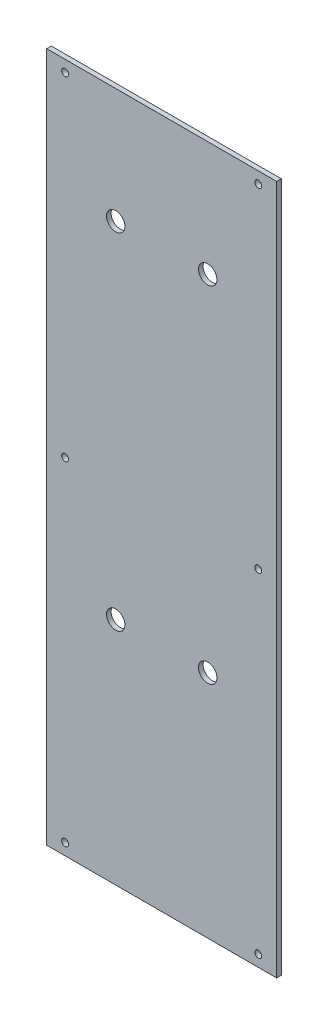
ISO-10303-21;
HEADER;
FILE_DESCRIPTION(('STEP AP214'),'2;1');
FILE_NAME('part.step','',(''),(''),'','','');
FILE_SCHEMA(('AUTOMOTIVE_DESIGN { 1 0 10303 214 1 1 1 1 }'));
ENDSEC;
DATA;
#1=APPLICATION_CONTEXT('core data for automotive mechanical design processes');
#2=APPLICATION_PROTOCOL_DEFINITION('international standard','automotive_design',2000,#1);
#3=PRODUCT_CONTEXT('',#1,'mechanical');
#4=PRODUCT('Part','Part','',(#3));
#5=PRODUCT_RELATED_PRODUCT_CATEGORY('part','',(#4));
#6=PRODUCT_DEFINITION_FORMATION('','',#4);
#7=PRODUCT_DEFINITION_CONTEXT('part definition',#1,'design');
#8=PRODUCT_DEFINITION('design','',#6,#7);
#9=PRODUCT_DEFINITION_SHAPE('','',#8);
#10=(LENGTH_UNIT() NAMED_UNIT(*) SI_UNIT(.MILLI.,.METRE.));
#11=(NAMED_UNIT(*) PLANE_ANGLE_UNIT() SI_UNIT($,.RADIAN.));
#12=(NAMED_UNIT(*) SI_UNIT($,.STERADIAN.) SOLID_ANGLE_UNIT());
#13=UNCERTAINTY_MEASURE_WITH_UNIT(LENGTH_MEASURE(1.E-05),#10,'distance_accuracy_value','');
#14=(GEOMETRIC_REPRESENTATION_CONTEXT(3) GLOBAL_UNCERTAINTY_ASSIGNED_CONTEXT((#13)) GLOBAL_UNIT_ASSIGNED_CONTEXT((#10,
#11,#12)) REPRESENTATION_CONTEXT('',''));
#15=CARTESIAN_POINT('',(0.,0.,0.));
#16=DIRECTION('',(0.,0.,1.));
#17=DIRECTION('',(1.,0.,0.));
#18=AXIS2_PLACEMENT_3D('',#15,#16,#17);
#19=CARTESIAN_POINT('',(0.,0.,2.));
#20=DIRECTION('',(1.,0.,0.));
#21=DIRECTION('',(0.,0.,-1.));
#22=AXIS2_PLACEMENT_3D('',#19,#20,#21);
#23=PLANE('',#22);
#24=DIRECTION('',(0.,-1.,0.));
#25=VECTOR('',#24,1.);
#26=CARTESIAN_POINT('',(0.,0.,0.));
#27=LINE('',#26,#25);
#28=CARTESIAN_POINT('',(0.,300.,0.));
#29=VERTEX_POINT('',#28);
#30=CARTESIAN_POINT('',(0.,0.,0.));
#31=VERTEX_POINT('',#30);
#32=EDGE_CURVE('E73',#29,#31,#27,.T.);
#33=ORIENTED_EDGE('',*,*,#32,.T.);
#34=DIRECTION('',(0.,0.,-1.));
#35=VECTOR('',#34,1.);
#36=CARTESIAN_POINT('',(0.,0.,2.));
#37=LINE('',#36,#35);
#38=CARTESIAN_POINT('',(0.,0.,2.));
#39=VERTEX_POINT('',#38);
#40=EDGE_CURVE('E80',#39,#31,#37,.T.);
#41=ORIENTED_EDGE('',*,*,#40,.F.);
#42=DIRECTION('',(0.,-1.,0.));
#43=VECTOR('',#42,1.);
#44=CARTESIAN_POINT('',(0.,0.,2.));
#45=LINE('',#44,#43);
#46=CARTESIAN_POINT('',(0.,300.,2.));
#47=VERTEX_POINT('',#46);
#48=EDGE_CURVE('E100',#47,#39,#45,.T.);
#49=ORIENTED_EDGE('',*,*,#48,.F.);
#50=DIRECTION('',(0.,0.,-1.));
#51=VECTOR('',#50,1.);
#52=CARTESIAN_POINT('',(0.,300.,2.));
#53=LINE('',#52,#51);
#54=EDGE_CURVE('E89',#47,#29,#53,.T.);
#55=ORIENTED_EDGE('',*,*,#54,.T.);
#56=EDGE_LOOP('',(#33,#41,#49,#55));
#57=FACE_BOUND('',#56,.T.);
#58=ADVANCED_FACE('F26',(#57),#23,.F.);
#59=CARTESIAN_POINT('',(0.,0.,2.));
#60=DIRECTION('',(0.,1.,0.));
#61=DIRECTION('',(0.,0.,1.));
#62=AXIS2_PLACEMENT_3D('',#59,#60,#61);
#63=PLANE('',#62);
#64=DIRECTION('',(1.,0.,0.));
#65=VECTOR('',#64,1.);
#66=CARTESIAN_POINT('',(0.,0.,0.));
#67=LINE('',#66,#65);
#68=CARTESIAN_POINT('',(100.,0.,0.));
#69=VERTEX_POINT('',#68);
#70=EDGE_CURVE('E67',#31,#69,#67,.T.);
#71=ORIENTED_EDGE('',*,*,#70,.T.);
#72=DIRECTION('',(0.,0.,-1.));
#73=VECTOR('',#72,1.);
#74=CARTESIAN_POINT('',(100.,0.,2.));
#75=LINE('',#74,#73);
#76=CARTESIAN_POINT('',(100.,0.,2.));
#77=VERTEX_POINT('',#76);
#78=EDGE_CURVE('E86',#77,#69,#75,.T.);
#79=ORIENTED_EDGE('',*,*,#78,.F.);
#80=DIRECTION('',(1.,0.,0.));
#81=VECTOR('',#80,1.);
#82=CARTESIAN_POINT('',(0.,0.,2.));
#83=LINE('',#82,#81);
#84=EDGE_CURVE('E82',#39,#77,#83,.T.);
#85=ORIENTED_EDGE('',*,*,#84,.F.);
#86=ORIENTED_EDGE('',*,*,#40,.T.);
#87=EDGE_LOOP('',(#71,#79,#85,#86));
#88=FACE_BOUND('',#87,.T.);
#89=ADVANCED_FACE('F81',(#88),#63,.F.);
#90=CARTESIAN_POINT('',(100.,0.,2.));
#91=DIRECTION('',(-1.,0.,0.));
#92=DIRECTION('',(0.,0.,1.));
#93=AXIS2_PLACEMENT_3D('',#90,#91,#92);
#94=PLANE('',#93);
#95=DIRECTION('',(0.,1.,0.));
#96=VECTOR('',#95,1.);
#97=CARTESIAN_POINT('',(100.,0.,0.));
#98=LINE('',#97,#96);
#99=CARTESIAN_POINT('',(100.,300.,0.));
#100=VERTEX_POINT('',#99);
#101=EDGE_CURVE('E74',#69,#100,#98,.T.);
#102=ORIENTED_EDGE('',*,*,#101,.T.);
#103=DIRECTION('',(0.,0.,-1.));
#104=VECTOR('',#103,1.);
#105=CARTESIAN_POINT('',(100.,300.,2.));
#106=LINE('',#105,#104);
#107=CARTESIAN_POINT('',(100.,300.,2.));
#108=VERTEX_POINT('',#107);
#109=EDGE_CURVE('E106',#108,#100,#106,.T.);
#110=ORIENTED_EDGE('',*,*,#109,.F.);
#111=DIRECTION('',(0.,1.,0.));
#112=VECTOR('',#111,1.);
#113=CARTESIAN_POINT('',(100.,0.,2.));
#114=LINE('',#113,#112);
#115=EDGE_CURVE('E46',#77,#108,#114,.T.);
#116=ORIENTED_EDGE('',*,*,#115,.F.);
#117=ORIENTED_EDGE('',*,*,#78,.T.);
#118=EDGE_LOOP('',(#102,#110,#116,#117));
#119=FACE_BOUND('',#118,.T.);
#120=ADVANCED_FACE('F137',(#119),#94,.F.);
#121=CARTESIAN_POINT('',(0.,300.,2.));
#122=DIRECTION('',(0.,-1.,0.));
#123=DIRECTION('',(0.,0.,-1.));
#124=AXIS2_PLACEMENT_3D('',#121,#122,#123);
#125=PLANE('',#124);
#126=DIRECTION('',(-1.,0.,0.));
#127=VECTOR('',#126,1.);
#128=CARTESIAN_POINT('',(0.,300.,0.));
#129=LINE('',#128,#127);
#130=EDGE_CURVE('E98',#100,#29,#129,.T.);
#131=ORIENTED_EDGE('',*,*,#130,.T.);
#132=ORIENTED_EDGE('',*,*,#54,.F.);
#133=DIRECTION('',(-1.,0.,0.));
#134=VECTOR('',#133,1.);
#135=CARTESIAN_POINT('',(0.,300.,2.));
#136=LINE('',#135,#134);
#137=EDGE_CURVE('E41',#108,#47,#136,.T.);
#138=ORIENTED_EDGE('',*,*,#137,.F.);
#139=ORIENTED_EDGE('',*,*,#109,.T.);
#140=EDGE_LOOP('',(#131,#132,#138,#139));
#141=FACE_BOUND('',#140,.T.);
#142=ADVANCED_FACE('F126',(#141),#125,.F.);
#143=CARTESIAN_POINT('',(0.,300.,2.));
#144=DIRECTION('',(0.,0.,-1.));
#145=DIRECTION('',(-1.,0.,0.));
#146=AXIS2_PLACEMENT_3D('',#143,#144,#145);
#147=PLANE('',#146);
#148=CARTESIAN_POINT('',(92.,5.,2.));
#149=DIRECTION('',(0.,0.,1.));
#150=DIRECTION('',(1.,0.,0.));
#151=AXIS2_PLACEMENT_3D('',#148,#149,#150);
#152=CIRCLE('',#151,1.5);
#153=CARTESIAN_POINT('',(93.5,5.,2.));
#154=VERTEX_POINT('',#153);
#155=EDGE_CURVE('E197',#154,#154,#152,.T.);
#156=ORIENTED_EDGE('',*,*,#155,.F.);
#157=EDGE_LOOP('',(#156));
#158=FACE_BOUND('',#157,.T.);
#159=CARTESIAN_POINT('',(92.,150.,2.));
#160=DIRECTION('',(0.,0.,1.));
#161=DIRECTION('',(1.,0.,0.));
#162=AXIS2_PLACEMENT_3D('',#159,#160,#161);
#163=CIRCLE('',#162,1.5);
#164=CARTESIAN_POINT('',(93.5,150.,2.));
#165=VERTEX_POINT('',#164);
#166=EDGE_CURVE('E199',#165,#165,#163,.T.);
#167=ORIENTED_EDGE('',*,*,#166,.F.);
#168=EDGE_LOOP('',(#167));
#169=FACE_BOUND('',#168,.T.);
#170=CARTESIAN_POINT('',(92.,295.,2.));
#171=DIRECTION('',(0.,0.,1.));
#172=DIRECTION('',(1.,0.,0.));
#173=AXIS2_PLACEMENT_3D('',#170,#171,#172);
#174=CIRCLE('',#173,1.5);
#175=CARTESIAN_POINT('',(93.5,295.,2.));
#176=VERTEX_POINT('',#175);
#177=EDGE_CURVE('E207',#176,#176,#174,.T.);
#178=ORIENTED_EDGE('',*,*,#177,.F.);
#179=EDGE_LOOP('',(#178));
#180=FACE_BOUND('',#179,.T.);
#181=CARTESIAN_POINT('',(8.,5.,2.));
#182=DIRECTION('',(0.,0.,1.));
#183=DIRECTION('',(1.,0.,0.));
#184=AXIS2_PLACEMENT_3D('',#181,#182,#183);
#185=CIRCLE('',#184,1.5);
#186=CARTESIAN_POINT('',(9.5,5.,2.));
#187=VERTEX_POINT('',#186);
#188=EDGE_CURVE('E213',#187,#187,#185,.T.);
#189=ORIENTED_EDGE('',*,*,#188,.F.);
#190=EDGE_LOOP('',(#189));
#191=FACE_BOUND('',#190,.T.);
#192=CARTESIAN_POINT('',(8.,150.,2.));
#193=DIRECTION('',(0.,0.,1.));
#194=DIRECTION('',(1.,0.,0.));
#195=AXIS2_PLACEMENT_3D('',#192,#193,#194);
#196=CIRCLE('',#195,1.5);
#197=CARTESIAN_POINT('',(9.5,150.,2.));
#198=VERTEX_POINT('',#197);
#199=EDGE_CURVE('E219',#198,#198,#196,.T.);
#200=ORIENTED_EDGE('',*,*,#199,.F.);
#201=EDGE_LOOP('',(#200));
#202=FACE_BOUND('',#201,.T.);
#203=CARTESIAN_POINT('',(8.,295.,2.));
#204=DIRECTION('',(0.,0.,1.));
#205=DIRECTION('',(1.,0.,0.));
#206=AXIS2_PLACEMENT_3D('',#203,#204,#205);
#207=CIRCLE('',#206,1.5);
#208=CARTESIAN_POINT('',(9.5,295.,2.));
#209=VERTEX_POINT('',#208);
#210=EDGE_CURVE('E225',#209,#209,#207,.T.);
#211=ORIENTED_EDGE('',*,*,#210,.F.);
#212=EDGE_LOOP('',(#211));
#213=FACE_BOUND('',#212,.T.);
#214=CARTESIAN_POINT('',(70.,250.,2.));
#215=DIRECTION('',(0.,0.,1.));
#216=DIRECTION('',(1.,0.,0.));
#217=AXIS2_PLACEMENT_3D('',#214,#215,#216);
#218=CIRCLE('',#217,4.00000000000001);
#219=CARTESIAN_POINT('',(74.,250.,2.));
#220=VERTEX_POINT('',#219);
#221=EDGE_CURVE('E234',#220,#220,#218,.T.);
#222=ORIENTED_EDGE('',*,*,#221,.F.);
#223=EDGE_LOOP('',(#222));
#224=FACE_BOUND('',#223,.T.);
#225=CARTESIAN_POINT('',(30.,250.,2.));
#226=DIRECTION('',(0.,0.,1.));
#227=DIRECTION('',(1.,0.,0.));
#228=AXIS2_PLACEMENT_3D('',#225,#226,#227);
#229=CIRCLE('',#228,4.00000000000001);
#230=CARTESIAN_POINT('',(34.,250.,2.));
#231=VERTEX_POINT('',#230);
#232=EDGE_CURVE('E93',#231,#231,#229,.T.);
#233=ORIENTED_EDGE('',*,*,#232,.F.);
#234=EDGE_LOOP('',(#233));
#235=FACE_BOUND('',#234,.T.);
#236=ORIENTED_EDGE('',*,*,#48,.T.);
#237=ORIENTED_EDGE('',*,*,#84,.T.);
#238=ORIENTED_EDGE('',*,*,#115,.T.);
#239=ORIENTED_EDGE('',*,*,#137,.T.);
#240=EDGE_LOOP('',(#236,#237,#238,#239));
#241=FACE_BOUND('',#240,.T.);
#242=CARTESIAN_POINT('',(30.,100.,2.));
#243=DIRECTION('',(0.,0.,1.));
#244=DIRECTION('',(1.,0.,0.));
#245=AXIS2_PLACEMENT_3D('',#242,#243,#244);
#246=CIRCLE('',#245,4.00000000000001);
#247=CARTESIAN_POINT('',(34.,100.,2.));
#248=VERTEX_POINT('',#247);
#249=EDGE_CURVE('E112',#248,#248,#246,.T.);
#250=ORIENTED_EDGE('',*,*,#249,.F.);
#251=EDGE_LOOP('',(#250));
#252=FACE_BOUND('',#251,.T.);
#253=CARTESIAN_POINT('',(70.,100.,2.));
#254=DIRECTION('',(0.,0.,1.));
#255=DIRECTION('',(1.,0.,0.));
#256=AXIS2_PLACEMENT_3D('',#253,#254,#255);
#257=CIRCLE('',#256,4.00000000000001);
#258=CARTESIAN_POINT('',(74.,100.,2.));
#259=VERTEX_POINT('',#258);
#260=EDGE_CURVE('E11',#259,#259,#257,.T.);
#261=ORIENTED_EDGE('',*,*,#260,.F.);
#262=EDGE_LOOP('',(#261));
#263=FACE_BOUND('',#262,.T.);
#264=ADVANCED_FACE('F124',(#158,#169,#180,#191,#202,#213,#224,#235,#241,#252,#263),#147,.F.);
#265=CARTESIAN_POINT('',(0.,300.,0.));
#266=DIRECTION('',(0.,0.,-1.));
#267=DIRECTION('',(-1.,0.,0.));
#268=AXIS2_PLACEMENT_3D('',#265,#266,#267);
#269=PLANE('',#268);
#270=CARTESIAN_POINT('',(92.,5.,0.));
#271=DIRECTION('',(0.,0.,1.));
#272=DIRECTION('',(1.,0.,0.));
#273=AXIS2_PLACEMENT_3D('',#270,#271,#272);
#274=CIRCLE('',#273,1.5);
#275=CARTESIAN_POINT('',(93.5,5.,0.));
#276=VERTEX_POINT('',#275);
#277=EDGE_CURVE('E195',#276,#276,#274,.T.);
#278=ORIENTED_EDGE('',*,*,#277,.T.);
#279=EDGE_LOOP('',(#278));
#280=FACE_BOUND('',#279,.T.);
#281=CARTESIAN_POINT('',(92.,150.,0.));
#282=DIRECTION('',(0.,0.,1.));
#283=DIRECTION('',(1.,0.,0.));
#284=AXIS2_PLACEMENT_3D('',#281,#282,#283);
#285=CIRCLE('',#284,1.5);
#286=CARTESIAN_POINT('',(93.5,150.,0.));
#287=VERTEX_POINT('',#286);
#288=EDGE_CURVE('E204',#287,#287,#285,.T.);
#289=ORIENTED_EDGE('',*,*,#288,.T.);
#290=EDGE_LOOP('',(#289));
#291=FACE_BOUND('',#290,.T.);
#292=CARTESIAN_POINT('',(92.,295.,0.));
#293=DIRECTION('',(0.,0.,1.));
#294=DIRECTION('',(1.,0.,0.));
#295=AXIS2_PLACEMENT_3D('',#292,#293,#294);
#296=CIRCLE('',#295,1.5);
#297=CARTESIAN_POINT('',(93.5,295.,0.));
#298=VERTEX_POINT('',#297);
#299=EDGE_CURVE('E210',#298,#298,#296,.T.);
#300=ORIENTED_EDGE('',*,*,#299,.T.);
#301=EDGE_LOOP('',(#300));
#302=FACE_BOUND('',#301,.T.);
#303=CARTESIAN_POINT('',(8.,5.,0.));
#304=DIRECTION('',(0.,0.,1.));
#305=DIRECTION('',(1.,0.,0.));
#306=AXIS2_PLACEMENT_3D('',#303,#304,#305);
#307=CIRCLE('',#306,1.5);
#308=CARTESIAN_POINT('',(9.5,5.,0.));
#309=VERTEX_POINT('',#308);
#310=EDGE_CURVE('E216',#309,#309,#307,.T.);
#311=ORIENTED_EDGE('',*,*,#310,.T.);
#312=EDGE_LOOP('',(#311));
#313=FACE_BOUND('',#312,.T.);
#314=CARTESIAN_POINT('',(8.,150.,0.));
#315=DIRECTION('',(0.,0.,1.));
#316=DIRECTION('',(1.,0.,0.));
#317=AXIS2_PLACEMENT_3D('',#314,#315,#316);
#318=CIRCLE('',#317,1.5);
#319=CARTESIAN_POINT('',(9.5,150.,0.));
#320=VERTEX_POINT('',#319);
#321=EDGE_CURVE('E222',#320,#320,#318,.T.);
#322=ORIENTED_EDGE('',*,*,#321,.T.);
#323=EDGE_LOOP('',(#322));
#324=FACE_BOUND('',#323,.T.);
#325=CARTESIAN_POINT('',(8.,295.,0.));
#326=DIRECTION('',(0.,0.,1.));
#327=DIRECTION('',(1.,0.,0.));
#328=AXIS2_PLACEMENT_3D('',#325,#326,#327);
#329=CIRCLE('',#328,1.5);
#330=CARTESIAN_POINT('',(9.5,295.,0.));
#331=VERTEX_POINT('',#330);
#332=EDGE_CURVE('E228',#331,#331,#329,.T.);
#333=ORIENTED_EDGE('',*,*,#332,.T.);
#334=EDGE_LOOP('',(#333));
#335=FACE_BOUND('',#334,.T.);
#336=CARTESIAN_POINT('',(70.,250.,0.));
#337=DIRECTION('',(0.,0.,1.));
#338=DIRECTION('',(1.,0.,0.));
#339=AXIS2_PLACEMENT_3D('',#336,#337,#338);
#340=CIRCLE('',#339,4.00000000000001);
#341=CARTESIAN_POINT('',(74.,250.,0.));
#342=VERTEX_POINT('',#341);
#343=EDGE_CURVE('E231',#342,#342,#340,.T.);
#344=ORIENTED_EDGE('',*,*,#343,.T.);
#345=EDGE_LOOP('',(#344));
#346=FACE_BOUND('',#345,.T.);
#347=CARTESIAN_POINT('',(30.,250.,0.));
#348=DIRECTION('',(0.,0.,1.));
#349=DIRECTION('',(1.,0.,0.));
#350=AXIS2_PLACEMENT_3D('',#347,#348,#349);
#351=CIRCLE('',#350,4.00000000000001);
#352=CARTESIAN_POINT('',(34.,250.,0.));
#353=VERTEX_POINT('',#352);
#354=EDGE_CURVE('E90',#353,#353,#351,.T.);
#355=ORIENTED_EDGE('',*,*,#354,.T.);
#356=EDGE_LOOP('',(#355));
#357=FACE_BOUND('',#356,.T.);
#358=ORIENTED_EDGE('',*,*,#32,.F.);
#359=ORIENTED_EDGE('',*,*,#130,.F.);
#360=ORIENTED_EDGE('',*,*,#101,.F.);
#361=ORIENTED_EDGE('',*,*,#70,.F.);
#362=EDGE_LOOP('',(#358,#359,#360,#361));
#363=FACE_BOUND('',#362,.T.);
#364=CARTESIAN_POINT('',(30.,100.,0.));
#365=DIRECTION('',(0.,0.,1.));
#366=DIRECTION('',(1.,0.,0.));
#367=AXIS2_PLACEMENT_3D('',#364,#365,#366);
#368=CIRCLE('',#367,4.00000000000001);
#369=CARTESIAN_POINT('',(34.,100.,0.));
#370=VERTEX_POINT('',#369);
#371=EDGE_CURVE('E85',#370,#370,#368,.T.);
#372=ORIENTED_EDGE('',*,*,#371,.T.);
#373=EDGE_LOOP('',(#372));
#374=FACE_BOUND('',#373,.T.);
#375=CARTESIAN_POINT('',(70.,100.,0.));
#376=DIRECTION('',(0.,0.,1.));
#377=DIRECTION('',(1.,0.,0.));
#378=AXIS2_PLACEMENT_3D('',#375,#376,#377);
#379=CIRCLE('',#378,4.00000000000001);
#380=CARTESIAN_POINT('',(74.,100.,0.));
#381=VERTEX_POINT('',#380);
#382=EDGE_CURVE('E34',#381,#381,#379,.T.);
#383=ORIENTED_EDGE('',*,*,#382,.T.);
#384=EDGE_LOOP('',(#383));
#385=FACE_BOUND('',#384,.T.);
#386=ADVANCED_FACE('F69',(#280,#291,#302,#313,#324,#335,#346,#357,#363,#374,#385),#269,.T.);
#387=CARTESIAN_POINT('',(30.,250.,0.));
#388=DIRECTION('',(0.,0.,1.));
#389=DIRECTION('',(1.,0.,0.));
#390=AXIS2_PLACEMENT_3D('',#387,#388,#389);
#391=CYLINDRICAL_SURFACE('',#390,4.00000000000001);
#392=ORIENTED_EDGE('',*,*,#354,.F.);
#393=EDGE_LOOP('',(#392));
#394=FACE_BOUND('',#393,.T.);
#395=ORIENTED_EDGE('',*,*,#232,.T.);
#396=EDGE_LOOP('',(#395));
#397=FACE_BOUND('',#396,.T.);
#398=ADVANCED_FACE('F133',(#394,#397),#391,.F.);
#399=CARTESIAN_POINT('',(70.,250.,0.));
#400=DIRECTION('',(0.,0.,1.));
#401=DIRECTION('',(1.,0.,0.));
#402=AXIS2_PLACEMENT_3D('',#399,#400,#401);
#403=CYLINDRICAL_SURFACE('',#402,4.00000000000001);
#404=ORIENTED_EDGE('',*,*,#343,.F.);
#405=EDGE_LOOP('',(#404));
#406=FACE_BOUND('',#405,.T.);
#407=ORIENTED_EDGE('',*,*,#221,.T.);
#408=EDGE_LOOP('',(#407));
#409=FACE_BOUND('',#408,.T.);
#410=ADVANCED_FACE('F150',(#406,#409),#403,.F.);
#411=CARTESIAN_POINT('',(30.,100.,0.));
#412=DIRECTION('',(0.,0.,1.));
#413=DIRECTION('',(1.,0.,0.));
#414=AXIS2_PLACEMENT_3D('',#411,#412,#413);
#415=CYLINDRICAL_SURFACE('',#414,4.00000000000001);
#416=ORIENTED_EDGE('',*,*,#371,.F.);
#417=EDGE_LOOP('',(#416));
#418=FACE_BOUND('',#417,.T.);
#419=ORIENTED_EDGE('',*,*,#249,.T.);
#420=EDGE_LOOP('',(#419));
#421=FACE_BOUND('',#420,.T.);
#422=ADVANCED_FACE('F121',(#418,#421),#415,.F.);
#423=CARTESIAN_POINT('',(70.,100.,0.));
#424=DIRECTION('',(0.,0.,1.));
#425=DIRECTION('',(1.,0.,0.));
#426=AXIS2_PLACEMENT_3D('',#423,#424,#425);
#427=CYLINDRICAL_SURFACE('',#426,4.00000000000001);
#428=ORIENTED_EDGE('',*,*,#382,.F.);
#429=EDGE_LOOP('',(#428));
#430=FACE_BOUND('',#429,.T.);
#431=ORIENTED_EDGE('',*,*,#260,.T.);
#432=EDGE_LOOP('',(#431));
#433=FACE_BOUND('',#432,.T.);
#434=ADVANCED_FACE('F28',(#430,#433),#427,.F.);
#435=CARTESIAN_POINT('',(8.,295.,0.));
#436=DIRECTION('',(0.,0.,1.));
#437=DIRECTION('',(1.,0.,0.));
#438=AXIS2_PLACEMENT_3D('',#435,#436,#437);
#439=CYLINDRICAL_SURFACE('',#438,1.5);
#440=ORIENTED_EDGE('',*,*,#332,.F.);
#441=EDGE_LOOP('',(#440));
#442=FACE_BOUND('',#441,.T.);
#443=ORIENTED_EDGE('',*,*,#210,.T.);
#444=EDGE_LOOP('',(#443));
#445=FACE_BOUND('',#444,.T.);
#446=ADVANCED_FACE('F120',(#442,#445),#439,.F.);
#447=CARTESIAN_POINT('',(8.,150.,0.));
#448=DIRECTION('',(0.,0.,1.));
#449=DIRECTION('',(1.,0.,0.));
#450=AXIS2_PLACEMENT_3D('',#447,#448,#449);
#451=CYLINDRICAL_SURFACE('',#450,1.5);
#452=ORIENTED_EDGE('',*,*,#321,.F.);
#453=EDGE_LOOP('',(#452));
#454=FACE_BOUND('',#453,.T.);
#455=ORIENTED_EDGE('',*,*,#199,.T.);
#456=EDGE_LOOP('',(#455));
#457=FACE_BOUND('',#456,.T.);
#458=ADVANCED_FACE('F170',(#454,#457),#451,.F.);
#459=CARTESIAN_POINT('',(8.,5.,0.));
#460=DIRECTION('',(0.,0.,1.));
#461=DIRECTION('',(1.,0.,0.));
#462=AXIS2_PLACEMENT_3D('',#459,#460,#461);
#463=CYLINDRICAL_SURFACE('',#462,1.5);
#464=ORIENTED_EDGE('',*,*,#310,.F.);
#465=EDGE_LOOP('',(#464));
#466=FACE_BOUND('',#465,.T.);
#467=ORIENTED_EDGE('',*,*,#188,.T.);
#468=EDGE_LOOP('',(#467));
#469=FACE_BOUND('',#468,.T.);
#470=ADVANCED_FACE('F174',(#466,#469),#463,.F.);
#471=CARTESIAN_POINT('',(92.,295.,0.));
#472=DIRECTION('',(0.,0.,1.));
#473=DIRECTION('',(1.,0.,0.));
#474=AXIS2_PLACEMENT_3D('',#471,#472,#473);
#475=CYLINDRICAL_SURFACE('',#474,1.5);
#476=ORIENTED_EDGE('',*,*,#299,.F.);
#477=EDGE_LOOP('',(#476));
#478=FACE_BOUND('',#477,.T.);
#479=ORIENTED_EDGE('',*,*,#177,.T.);
#480=EDGE_LOOP('',(#479));
#481=FACE_BOUND('',#480,.T.);
#482=ADVANCED_FACE('F178',(#478,#481),#475,.F.);
#483=CARTESIAN_POINT('',(92.,150.,0.));
#484=DIRECTION('',(0.,0.,1.));
#485=DIRECTION('',(1.,0.,0.));
#486=AXIS2_PLACEMENT_3D('',#483,#484,#485);
#487=CYLINDRICAL_SURFACE('',#486,1.5);
#488=ORIENTED_EDGE('',*,*,#288,.F.);
#489=EDGE_LOOP('',(#488));
#490=FACE_BOUND('',#489,.T.);
#491=ORIENTED_EDGE('',*,*,#166,.T.);
#492=EDGE_LOOP('',(#491));
#493=FACE_BOUND('',#492,.T.);
#494=ADVANCED_FACE('F182',(#490,#493),#487,.F.);
#495=CARTESIAN_POINT('',(92.,5.,0.));
#496=DIRECTION('',(0.,0.,1.));
#497=DIRECTION('',(1.,0.,0.));
#498=AXIS2_PLACEMENT_3D('',#495,#496,#497);
#499=CYLINDRICAL_SURFACE('',#498,1.5);
#500=ORIENTED_EDGE('',*,*,#277,.F.);
#501=EDGE_LOOP('',(#500));
#502=FACE_BOUND('',#501,.T.);
#503=ORIENTED_EDGE('',*,*,#155,.T.);
#504=EDGE_LOOP('',(#503));
#505=FACE_BOUND('',#504,.T.);
#506=ADVANCED_FACE('F186',(#502,#505),#499,.F.);
#507=CLOSED_SHELL('',(#58,#89,#120,#142,#264,#386,#398,#410,#422,#434,#446,#458,#470,#482,#494,#506));
#508=MANIFOLD_SOLID_BREP('B2',#507);
#509=ADVANCED_BREP_SHAPE_REPRESENTATION('',(#18,#508),#14);
#510=SHAPE_DEFINITION_REPRESENTATION(#9,#509);
ENDSEC;
END-ISO-10303-21;
